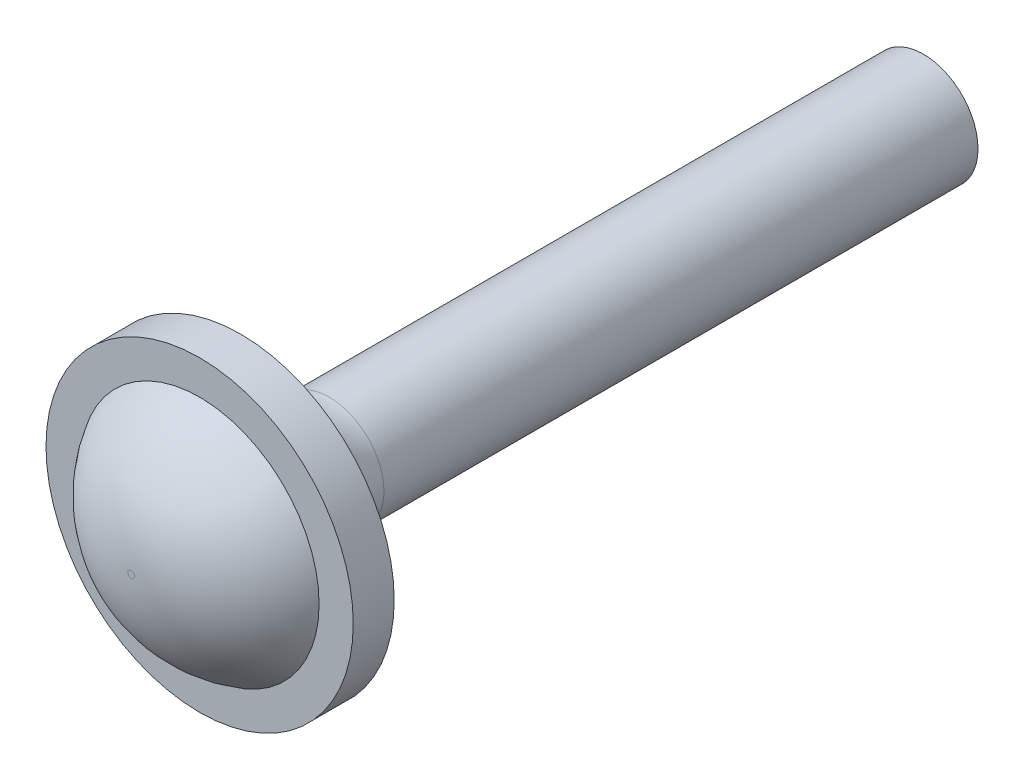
ISO-10303-21;
HEADER;
FILE_DESCRIPTION(('STEP AP214'),'2;1');
FILE_NAME('part.step','',(''),(''),'','','');
FILE_SCHEMA(('AUTOMOTIVE_DESIGN { 1 0 10303 214 1 1 1 1 }'));
ENDSEC;
DATA;
#1=APPLICATION_CONTEXT('core data for automotive mechanical design processes');
#2=APPLICATION_PROTOCOL_DEFINITION('international standard','automotive_design',2000,#1);
#3=PRODUCT_CONTEXT('',#1,'mechanical');
#4=PRODUCT('Part','Part','',(#3));
#5=PRODUCT_RELATED_PRODUCT_CATEGORY('part','',(#4));
#6=PRODUCT_DEFINITION_FORMATION('','',#4);
#7=PRODUCT_DEFINITION_CONTEXT('part definition',#1,'design');
#8=PRODUCT_DEFINITION('design','',#6,#7);
#9=PRODUCT_DEFINITION_SHAPE('','',#8);
#10=(LENGTH_UNIT() NAMED_UNIT(*) SI_UNIT(.MILLI.,.METRE.));
#11=(NAMED_UNIT(*) PLANE_ANGLE_UNIT() SI_UNIT($,.RADIAN.));
#12=(NAMED_UNIT(*) SI_UNIT($,.STERADIAN.) SOLID_ANGLE_UNIT());
#13=UNCERTAINTY_MEASURE_WITH_UNIT(LENGTH_MEASURE(1.E-05),#10,'distance_accuracy_value','');
#14=(GEOMETRIC_REPRESENTATION_CONTEXT(3) GLOBAL_UNCERTAINTY_ASSIGNED_CONTEXT((#13)) GLOBAL_UNIT_ASSIGNED_CONTEXT((#10,
#11,#12)) REPRESENTATION_CONTEXT('',''));
#15=CARTESIAN_POINT('',(0.,0.,0.));
#16=DIRECTION('',(0.,0.,1.));
#17=DIRECTION('',(1.,0.,0.));
#18=AXIS2_PLACEMENT_3D('',#15,#16,#17);
#19=CARTESIAN_POINT('',(0.,0.,-1.3));
#20=DIRECTION('',(0.,0.,1.));
#21=DIRECTION('',(1.,0.,0.));
#22=AXIS2_PLACEMENT_3D('',#19,#20,#21);
#23=TOROIDAL_SURFACE('',#22,2.1,1.3);
#24=CARTESIAN_POINT('',(0.,0.,0.));
#25=DIRECTION('',(0.,0.,1.));
#26=DIRECTION('',(1.,0.,0.));
#27=AXIS2_PLACEMENT_3D('',#24,#25,#26);
#28=CIRCLE('',#27,2.1);
#29=CARTESIAN_POINT('',(2.1,0.,0.));
#30=VERTEX_POINT('',#29);
#31=EDGE_CURVE('E1076',#30,#30,#28,.T.);
#32=ORIENTED_EDGE('',*,*,#31,.F.);
#33=EDGE_LOOP('',(#32));
#34=FACE_BOUND('',#33,.T.);
#35=CARTESIAN_POINT('',(0.,0.,-1.3));
#36=DIRECTION('',(0.,0.,1.));
#37=DIRECTION('',(1.,0.,0.));
#38=AXIS2_PLACEMENT_3D('',#35,#36,#37);
#39=CIRCLE('',#38,0.799999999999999);
#40=CARTESIAN_POINT('',(0.799999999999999,0.,-1.3));
#41=VERTEX_POINT('',#40);
#42=EDGE_CURVE('E10',#41,#41,#39,.F.);
#43=ORIENTED_EDGE('',*,*,#42,.F.);
#44=EDGE_LOOP('',(#43));
#45=FACE_BOUND('',#44,.T.);
#46=ADVANCED_FACE('F1070',(#34,#45),#23,.F.);
#47=CARTESIAN_POINT('',(0.,0.,-10.));
#48=DIRECTION('',(0.,0.,1.));
#49=DIRECTION('',(1.,0.,0.));
#50=AXIS2_PLACEMENT_3D('',#47,#48,#49);
#51=PLANE('',#50);
#52=CARTESIAN_POINT('',(0.,0.,-10.));
#53=DIRECTION('',(0.,0.,1.));
#54=DIRECTION('',(1.,0.,0.));
#55=AXIS2_PLACEMENT_3D('',#52,#53,#54);
#56=CIRCLE('',#55,0.799999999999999);
#57=CARTESIAN_POINT('',(0.799999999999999,0.,-10.));
#58=VERTEX_POINT('',#57);
#59=EDGE_CURVE('E1080',#58,#58,#56,.T.);
#60=ORIENTED_EDGE('',*,*,#59,.F.);
#61=EDGE_LOOP('',(#60));
#62=FACE_BOUND('',#61,.T.);
#63=ADVANCED_FACE('F1126',(#62),#51,.F.);
#64=CARTESIAN_POINT('',(0.,0.,0.));
#65=DIRECTION('',(0.,0.,1.));
#66=DIRECTION('',(1.,0.,0.));
#67=AXIS2_PLACEMENT_3D('',#64,#65,#66);
#68=CYLINDRICAL_SURFACE('',#67,0.799999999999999);
#69=ORIENTED_EDGE('',*,*,#42,.T.);
#70=EDGE_LOOP('',(#69));
#71=FACE_BOUND('',#70,.T.);
#72=ORIENTED_EDGE('',*,*,#59,.T.);
#73=EDGE_LOOP('',(#72));
#74=FACE_BOUND('',#73,.T.);
#75=ADVANCED_FACE('F1121',(#71,#74),#68,.T.);
#76=CARTESIAN_POINT('',(0.,0.584198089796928,0.));
#77=DIRECTION('',(0.,0.,1.));
#78=DIRECTION('',(1.,0.,0.));
#79=AXIS2_PLACEMENT_3D('',#76,#77,#78);
#80=PLANE('',#79);
#81=ORIENTED_EDGE('',*,*,#31,.T.);
#82=EDGE_LOOP('',(#81));
#83=FACE_BOUND('',#82,.T.);
#84=CARTESIAN_POINT('',(0.,0.,0.));
#85=DIRECTION('',(0.,0.,1.));
#86=DIRECTION('',(1.,0.,0.));
#87=AXIS2_PLACEMENT_3D('',#84,#85,#86);
#88=CIRCLE('',#87,2.25);
#89=CARTESIAN_POINT('',(2.25,0.,0.));
#90=VERTEX_POINT('',#89);
#91=EDGE_CURVE('E1084',#90,#90,#88,.T.);
#92=ORIENTED_EDGE('',*,*,#91,.F.);
#93=EDGE_LOOP('',(#92));
#94=FACE_BOUND('',#93,.T.);
#95=ADVANCED_FACE('F1116',(#83,#94),#80,.F.);
#96=CARTESIAN_POINT('',(0.,0.,0.));
#97=DIRECTION('',(0.,0.,1.));
#98=DIRECTION('',(1.,0.,0.));
#99=AXIS2_PLACEMENT_3D('',#96,#97,#98);
#100=CYLINDRICAL_SURFACE('',#99,2.25);
#101=CARTESIAN_POINT('',(0.,0.,0.6));
#102=DIRECTION('',(0.,0.,1.));
#103=DIRECTION('',(1.,0.,0.));
#104=AXIS2_PLACEMENT_3D('',#101,#102,#103);
#105=CIRCLE('',#104,2.25);
#106=CARTESIAN_POINT('',(2.25,0.,0.6));
#107=VERTEX_POINT('',#106);
#108=EDGE_CURVE('E1089',#107,#107,#105,.T.);
#109=ORIENTED_EDGE('',*,*,#108,.F.);
#110=EDGE_LOOP('',(#109));
#111=FACE_BOUND('',#110,.T.);
#112=ORIENTED_EDGE('',*,*,#91,.T.);
#113=EDGE_LOOP('',(#112));
#114=FACE_BOUND('',#113,.T.);
#115=ADVANCED_FACE('F1110',(#111,#114),#100,.T.);
#116=CARTESIAN_POINT('',(0.,1.75,0.6));
#117=DIRECTION('',(0.,0.,-1.));
#118=DIRECTION('',(-1.,0.,0.));
#119=AXIS2_PLACEMENT_3D('',#116,#117,#118);
#120=PLANE('',#119);
#121=CARTESIAN_POINT('',(0.,0.,0.6));
#122=DIRECTION('',(0.,0.,1.));
#123=DIRECTION('',(1.,0.,0.));
#124=AXIS2_PLACEMENT_3D('',#121,#122,#123);
#125=CIRCLE('',#124,1.75);
#126=CARTESIAN_POINT('',(1.75,0.,0.6));
#127=VERTEX_POINT('',#126);
#128=EDGE_CURVE('E1092',#127,#127,#125,.T.);
#129=ORIENTED_EDGE('',*,*,#128,.F.);
#130=EDGE_LOOP('',(#129));
#131=FACE_BOUND('',#130,.T.);
#132=ORIENTED_EDGE('',*,*,#108,.T.);
#133=EDGE_LOOP('',(#132));
#134=FACE_BOUND('',#133,.T.);
#135=ADVANCED_FACE('F1104',(#131,#134),#120,.F.);
#136=CARTESIAN_POINT('',(0.,0.,-0.344999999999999));
#137=DIRECTION('',(0.,0.,1.));
#138=DIRECTION('',(1.,0.,0.));
#139=AXIS2_PLACEMENT_3D('',#136,#137,#138);
#140=DEGENERATE_TOROIDAL_SURFACE('',#139,0.0500000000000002,1.945,.T.);
#141=CARTESIAN_POINT('',(0.,0.,1.6));
#142=DIRECTION('',(0.,0.,1.));
#143=DIRECTION('',(1.,0.,0.));
#144=AXIS2_PLACEMENT_3D('',#141,#142,#143);
#145=CIRCLE('',#144,0.0500000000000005);
#146=CARTESIAN_POINT('',(0.0500000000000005,0.,1.6));
#147=VERTEX_POINT('',#146);
#148=EDGE_CURVE('E1095',#147,#147,#145,.T.);
#149=ORIENTED_EDGE('',*,*,#148,.F.);
#150=EDGE_LOOP('',(#149));
#151=FACE_BOUND('',#150,.T.);
#152=ORIENTED_EDGE('',*,*,#128,.T.);
#153=EDGE_LOOP('',(#152));
#154=FACE_BOUND('',#153,.T.);
#155=ADVANCED_FACE('F1101',(#151,#154),#140,.T.);
#156=CARTESIAN_POINT('',(0.,0.05,1.6));
#157=DIRECTION('',(0.,0.,-1.));
#158=DIRECTION('',(-1.,0.,0.));
#159=AXIS2_PLACEMENT_3D('',#156,#157,#158);
#160=PLANE('',#159);
#161=ORIENTED_EDGE('',*,*,#148,.T.);
#162=EDGE_LOOP('',(#161));
#163=FACE_BOUND('',#162,.T.);
#164=ADVANCED_FACE('F1099',(#163),#160,.F.);
#165=CLOSED_SHELL('',(#46,#63,#75,#95,#115,#135,#155,#164));
#166=MANIFOLD_SOLID_BREP('B2',#165);
#167=ADVANCED_BREP_SHAPE_REPRESENTATION('',(#18,#166),#14);
#168=SHAPE_DEFINITION_REPRESENTATION(#9,#167);
ENDSEC;
END-ISO-10303-21;
